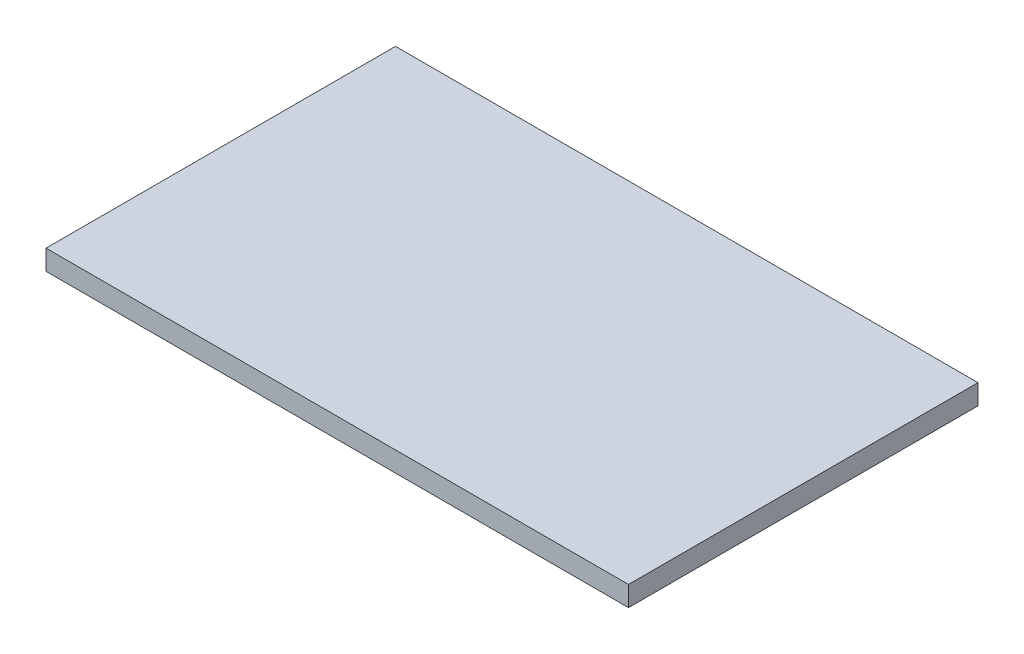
from build123d import *

# Parameters (mm, degrees)
SKETCH1_W           = 254
SKETCH1_H           = 152.4
BOSS_EXTRUDE1_DEPTH = 8.763


with BuildPart() as part:
    # Sketch1 → Boss-Extrude1 (new body)
    with BuildSketch(Plane(origin=(0, 0, 0), x_dir=(1, 0, 0), z_dir=(0, 1, 0))):
        with Locations((127, 76.2)):
            Rectangle(SKETCH1_W, SKETCH1_H)
    extrude(amount=BOSS_EXTRUDE1_DEPTH)


solid = part.part
